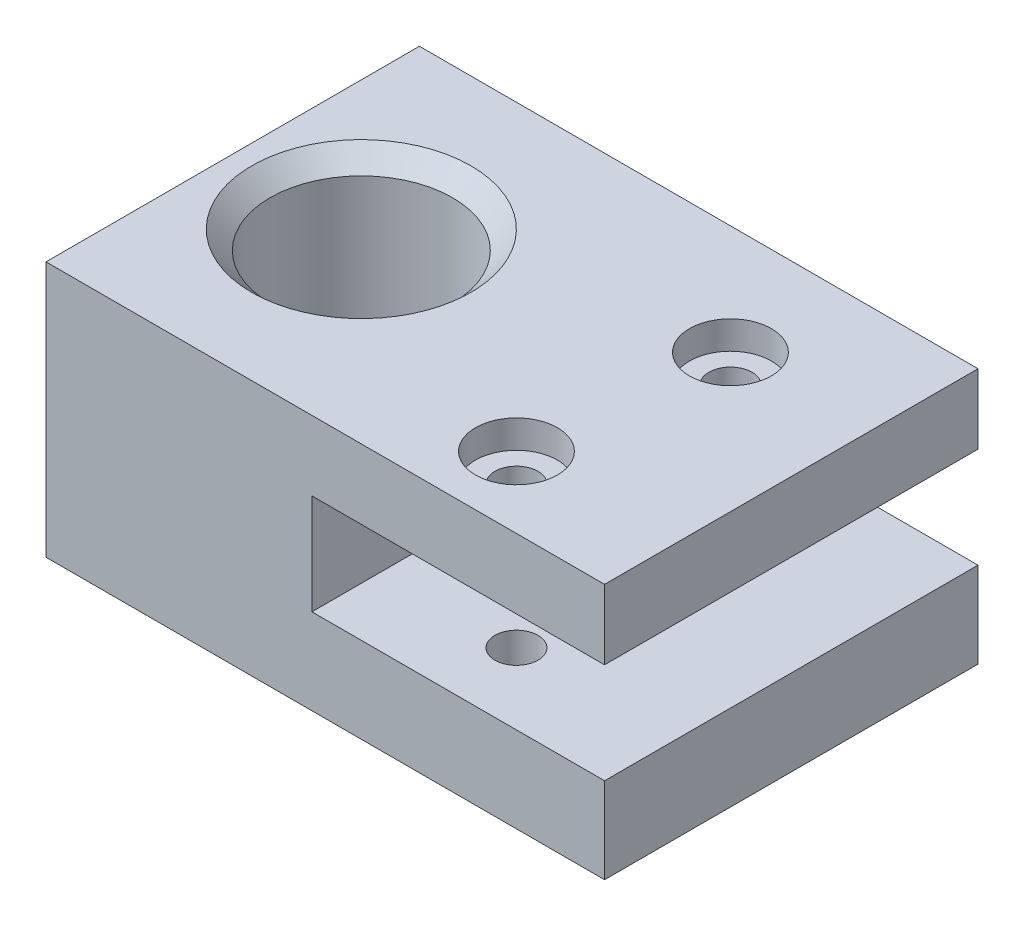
from build123d import *

# Parameters (mm, degrees)
SKETCH1_W                                          = 154.168044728
SKETCH1_H                                          = 103.072349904
EXTRUDE1_DEPTH                                     = 70.612
SKETCH2_W                                          = 84.027333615
SKETCH2_H                                          = 27.714278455
CUT_EXTRUDE1_DEPTH                                 = 155.279293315
SKETCH3_R                                          = 25.18218543
CUT_EXTRUDE2_DEPTH                                 = 129.981056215
CHAMFER1_SIZE                                      = 5.08
CBORE_FOR_7_16_PAN_HEAD_MACHINE_SCREW1_D           = 11.90498
CBORE_FOR_7_16_PAN_HEAD_MACHINE_SCREW1_CBORE_D     = 22.62124
CBORE_FOR_7_16_PAN_HEAD_MACHINE_SCREW1_CBORE_DEPTH = 7.747


with BuildPart() as part:
    # Sketch1 → Extrude1 (new body)
    with BuildSketch(Plane(origin=(0, 0, 0), x_dir=(1, 0, 0), z_dir=(0, 1, 0))):
        with Locations((13.426399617, -7.267922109)):
            Rectangle(SKETCH1_W, SKETCH1_H)
    extrude(amount=EXTRUDE1_DEPTH)

    # Sketch2 → Cut-Extrude1 (cut, through all)
    with BuildSketch(Plane.XY.offset(58.804097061)):
        with Locations((51.754657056, 37.517245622)):
            Rectangle(SKETCH2_W, SKETCH2_H)
    extrude(amount=-CUT_EXTRUDE1_DEPTH, mode=Mode.SUBTRACT)

    # Sketch3 → Cut-Extrude2 (cut, through all)
    with BuildSketch(Plane(origin=(0, 70.612, 0), x_dir=(-1, 0, 0), z_dir=(0, 1, 0))):
        with Locations(Location((27.971587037, 7.458696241, 0), (0, 0, 90))):
            Circle(SKETCH3_R)
    extrude(amount=-CUT_EXTRUDE2_DEPTH, mode=Mode.SUBTRACT)

    # Chamfer1
    chamfer1_edges = [part.edges().sort_by_distance(p)[0] for p in [
        (-27.971587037, 70.612, -17.72348919),
    ]]
    chamfer(chamfer1_edges, length=CHAMFER1_SIZE)

    # CBORE for 7_16 Pan Head Machine Screw1 (through all)
    with Locations(Plane(origin=(0, 70.612, 0), x_dir=(-1, 0, 0), z_dir=(0, 1, 0))):
        with Locations((-52.410421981, -14.040679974), (-46.561814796, 39.173870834)):
            CounterBoreHole(CBORE_FOR_7_16_PAN_HEAD_MACHINE_SCREW1_D / 2, CBORE_FOR_7_16_PAN_HEAD_MACHINE_SCREW1_CBORE_D / 2, CBORE_FOR_7_16_PAN_HEAD_MACHINE_SCREW1_CBORE_DEPTH)


solid = part.part
